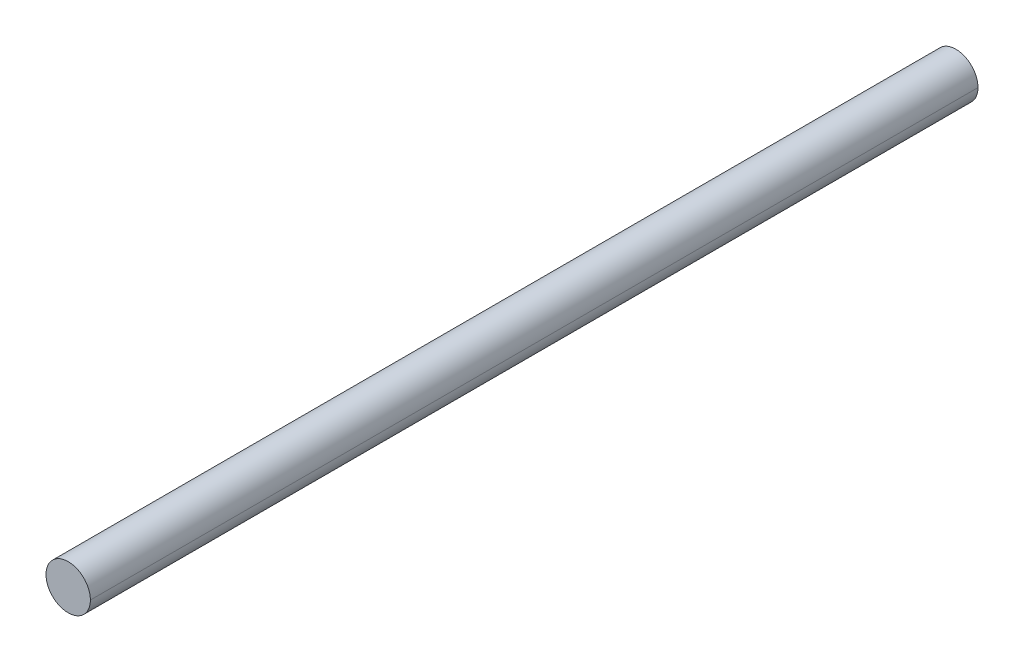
ISO-10303-21;
HEADER;
FILE_DESCRIPTION(('STEP AP214'),'2;1');
FILE_NAME('part.step','',(''),(''),'','','');
FILE_SCHEMA(('AUTOMOTIVE_DESIGN { 1 0 10303 214 1 1 1 1 }'));
ENDSEC;
DATA;
#1=APPLICATION_CONTEXT('core data for automotive mechanical design processes');
#2=APPLICATION_PROTOCOL_DEFINITION('international standard','automotive_design',2000,#1);
#3=PRODUCT_CONTEXT('',#1,'mechanical');
#4=PRODUCT('Part','Part','',(#3));
#5=PRODUCT_RELATED_PRODUCT_CATEGORY('part','',(#4));
#6=PRODUCT_DEFINITION_FORMATION('','',#4);
#7=PRODUCT_DEFINITION_CONTEXT('part definition',#1,'design');
#8=PRODUCT_DEFINITION('design','',#6,#7);
#9=PRODUCT_DEFINITION_SHAPE('','',#8);
#10=(LENGTH_UNIT() NAMED_UNIT(*) SI_UNIT(.MILLI.,.METRE.));
#11=(NAMED_UNIT(*) PLANE_ANGLE_UNIT() SI_UNIT($,.RADIAN.));
#12=(NAMED_UNIT(*) SI_UNIT($,.STERADIAN.) SOLID_ANGLE_UNIT());
#13=UNCERTAINTY_MEASURE_WITH_UNIT(LENGTH_MEASURE(1.E-05),#10,'distance_accuracy_value','');
#14=(GEOMETRIC_REPRESENTATION_CONTEXT(3) GLOBAL_UNCERTAINTY_ASSIGNED_CONTEXT((#13)) GLOBAL_UNIT_ASSIGNED_CONTEXT((#10,
#11,#12)) REPRESENTATION_CONTEXT('',''));
#15=CARTESIAN_POINT('',(0.,0.,0.));
#16=DIRECTION('',(0.,0.,1.));
#17=DIRECTION('',(1.,0.,0.));
#18=AXIS2_PLACEMENT_3D('',#15,#16,#17);
#19=CARTESIAN_POINT('',(0.,0.,-50.));
#20=DIRECTION('',(0.,0.,1.));
#21=DIRECTION('',(1.,0.,0.));
#22=AXIS2_PLACEMENT_3D('',#19,#20,#21);
#23=PLANE('',#22);
#24=CARTESIAN_POINT('',(0.,0.,-50.));
#25=DIRECTION('',(0.,0.,1.));
#26=DIRECTION('',(1.,0.,0.));
#27=AXIS2_PLACEMENT_3D('',#24,#25,#26);
#28=CIRCLE('',#27,2.5);
#29=CARTESIAN_POINT('',(-2.5,0.,-50.));
#30=VERTEX_POINT('',#29);
#31=CARTESIAN_POINT('',(2.5,0.,-50.));
#32=VERTEX_POINT('',#31);
#33=EDGE_CURVE('E11',#30,#32,#28,.T.);
#34=ORIENTED_EDGE('',*,*,#33,.F.);
#35=CARTESIAN_POINT('',(0.,0.,-50.));
#36=DIRECTION('',(0.,0.,1.));
#37=DIRECTION('',(1.,0.,0.));
#38=AXIS2_PLACEMENT_3D('',#35,#36,#37);
#39=CIRCLE('',#38,2.5);
#40=EDGE_CURVE('E66',#32,#30,#39,.T.);
#41=ORIENTED_EDGE('',*,*,#40,.F.);
#42=EDGE_LOOP('',(#34,#41));
#43=FACE_BOUND('',#42,.T.);
#44=ADVANCED_FACE('F17',(#43),#23,.F.);
#45=CARTESIAN_POINT('',(0.,0.,50.));
#46=DIRECTION('',(0.,0.,1.));
#47=DIRECTION('',(1.,0.,0.));
#48=AXIS2_PLACEMENT_3D('',#45,#46,#47);
#49=PLANE('',#48);
#50=CARTESIAN_POINT('',(0.,0.,50.));
#51=DIRECTION('',(0.,0.,1.));
#52=DIRECTION('',(1.,0.,0.));
#53=AXIS2_PLACEMENT_3D('',#50,#51,#52);
#54=CIRCLE('',#53,2.5);
#55=CARTESIAN_POINT('',(-2.5,0.,50.));
#56=VERTEX_POINT('',#55);
#57=CARTESIAN_POINT('',(2.5,0.,50.));
#58=VERTEX_POINT('',#57);
#59=EDGE_CURVE('E27',#56,#58,#54,.T.);
#60=ORIENTED_EDGE('',*,*,#59,.T.);
#61=CARTESIAN_POINT('',(0.,0.,50.));
#62=DIRECTION('',(0.,0.,1.));
#63=DIRECTION('',(1.,0.,0.));
#64=AXIS2_PLACEMENT_3D('',#61,#62,#63);
#65=CIRCLE('',#64,2.5);
#66=EDGE_CURVE('E21',#58,#56,#65,.T.);
#67=ORIENTED_EDGE('',*,*,#66,.T.);
#68=EDGE_LOOP('',(#60,#67));
#69=FACE_BOUND('',#68,.T.);
#70=ADVANCED_FACE('F55',(#69),#49,.T.);
#71=CARTESIAN_POINT('',(0.,0.,50.));
#72=DIRECTION('',(0.,0.,-1.));
#73=DIRECTION('',(-1.,0.,0.));
#74=AXIS2_PLACEMENT_3D('',#71,#72,#73);
#75=CYLINDRICAL_SURFACE('',#74,2.5);
#76=DIRECTION('',(0.,0.,-1.));
#77=VECTOR('',#76,1.);
#78=CARTESIAN_POINT('',(2.5,0.,50.));
#79=LINE('',#78,#77);
#80=EDGE_CURVE('E62',#58,#32,#79,.T.);
#81=ORIENTED_EDGE('',*,*,#80,.F.);
#82=ORIENTED_EDGE('',*,*,#59,.F.);
#83=DIRECTION('',(0.,0.,-1.));
#84=VECTOR('',#83,1.);
#85=CARTESIAN_POINT('',(-2.5,0.,50.));
#86=LINE('',#85,#84);
#87=EDGE_CURVE('E59',#56,#30,#86,.T.);
#88=ORIENTED_EDGE('',*,*,#87,.T.);
#89=ORIENTED_EDGE('',*,*,#33,.T.);
#90=EDGE_LOOP('',(#81,#82,#88,#89));
#91=FACE_BOUND('',#90,.T.);
#92=ADVANCED_FACE('F19',(#91),#75,.T.);
#93=CARTESIAN_POINT('',(0.,0.,50.));
#94=DIRECTION('',(0.,0.,-1.));
#95=DIRECTION('',(-1.,0.,0.));
#96=AXIS2_PLACEMENT_3D('',#93,#94,#95);
#97=CYLINDRICAL_SURFACE('',#96,2.5);
#98=ORIENTED_EDGE('',*,*,#66,.F.);
#99=ORIENTED_EDGE('',*,*,#80,.T.);
#100=ORIENTED_EDGE('',*,*,#40,.T.);
#101=ORIENTED_EDGE('',*,*,#87,.F.);
#102=EDGE_LOOP('',(#98,#99,#100,#101));
#103=FACE_BOUND('',#102,.T.);
#104=ADVANCED_FACE('F68',(#103),#97,.T.);
#105=CLOSED_SHELL('',(#44,#70,#92,#104));
#106=MANIFOLD_SOLID_BREP('B1',#105);
#107=ADVANCED_BREP_SHAPE_REPRESENTATION('',(#18,#106),#14);
#108=SHAPE_DEFINITION_REPRESENTATION(#9,#107);
ENDSEC;
END-ISO-10303-21;
